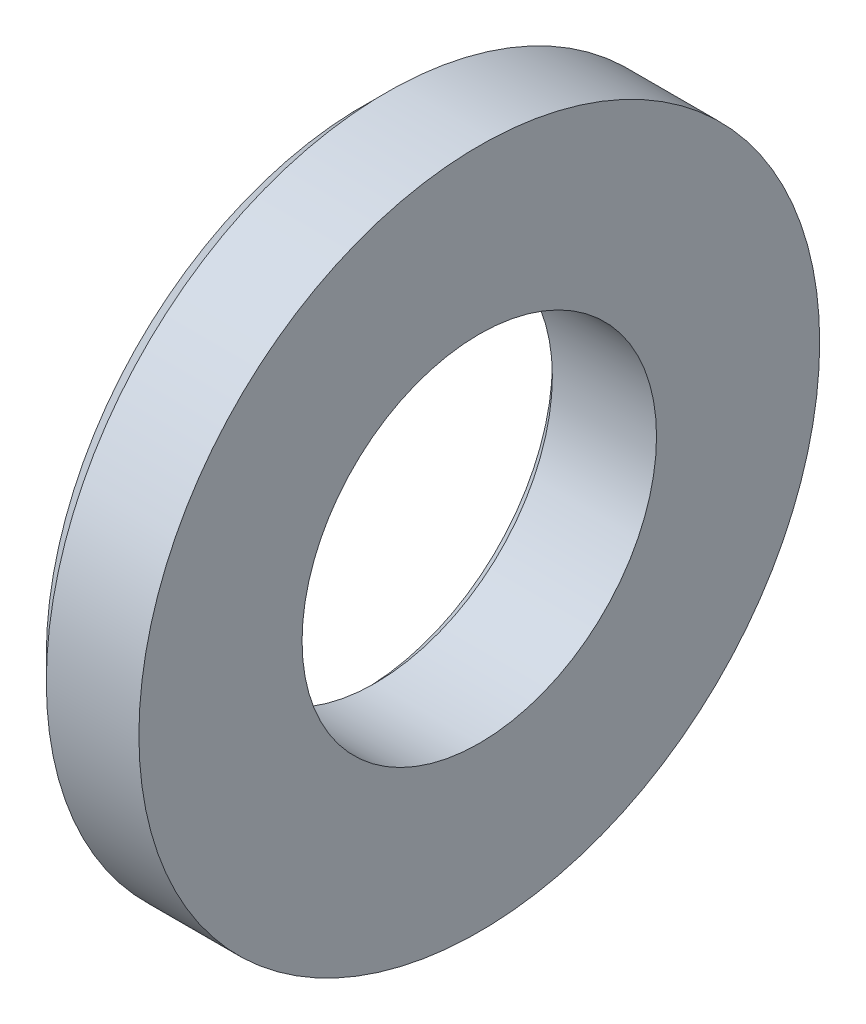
ISO-10303-21;
HEADER;
FILE_DESCRIPTION(('STEP AP214'),'2;1');
FILE_NAME('part.step','',(''),(''),'','','');
FILE_SCHEMA(('AUTOMOTIVE_DESIGN { 1 0 10303 214 1 1 1 1 }'));
ENDSEC;
DATA;
#1=APPLICATION_CONTEXT('core data for automotive mechanical design processes');
#2=APPLICATION_PROTOCOL_DEFINITION('international standard','automotive_design',2000,#1);
#3=PRODUCT_CONTEXT('',#1,'mechanical');
#4=PRODUCT('Part','Part','',(#3));
#5=PRODUCT_RELATED_PRODUCT_CATEGORY('part','',(#4));
#6=PRODUCT_DEFINITION_FORMATION('','',#4);
#7=PRODUCT_DEFINITION_CONTEXT('part definition',#1,'design');
#8=PRODUCT_DEFINITION('design','',#6,#7);
#9=PRODUCT_DEFINITION_SHAPE('','',#8);
#10=(LENGTH_UNIT() NAMED_UNIT(*) SI_UNIT(.MILLI.,.METRE.));
#11=(NAMED_UNIT(*) PLANE_ANGLE_UNIT() SI_UNIT($,.RADIAN.));
#12=(NAMED_UNIT(*) SI_UNIT($,.STERADIAN.) SOLID_ANGLE_UNIT());
#13=UNCERTAINTY_MEASURE_WITH_UNIT(LENGTH_MEASURE(1.E-05),#10,'distance_accuracy_value','');
#14=(GEOMETRIC_REPRESENTATION_CONTEXT(3) GLOBAL_UNCERTAINTY_ASSIGNED_CONTEXT((#13)) GLOBAL_UNIT_ASSIGNED_CONTEXT((#10,
#11,#12)) REPRESENTATION_CONTEXT('',''));
#15=CARTESIAN_POINT('',(0.,0.,0.));
#16=DIRECTION('',(0.,0.,1.));
#17=DIRECTION('',(1.,0.,0.));
#18=AXIS2_PLACEMENT_3D('',#15,#16,#17);
#19=CARTESIAN_POINT('',(3.2385,0.,0.));
#20=DIRECTION('',(1.,0.,0.));
#21=DIRECTION('',(0.,0.,-1.));
#22=AXIS2_PLACEMENT_3D('',#19,#20,#21);
#23=PLANE('',#22);
#24=CARTESIAN_POINT('',(3.2385,0.,0.));
#25=DIRECTION('',(1.,0.,0.));
#26=DIRECTION('',(0.,0.,-1.));
#27=AXIS2_PLACEMENT_3D('',#24,#25,#26);
#28=CIRCLE('',#27,19.05);
#29=CARTESIAN_POINT('',(3.2385,0.,-19.05));
#30=VERTEX_POINT('',#29);
#31=EDGE_CURVE('E50',#30,#30,#28,.T.);
#32=ORIENTED_EDGE('',*,*,#31,.T.);
#33=EDGE_LOOP('',(#32));
#34=FACE_BOUND('',#33,.T.);
#35=CARTESIAN_POINT('',(3.2385,0.,0.));
#36=DIRECTION('',(1.,0.,0.));
#37=DIRECTION('',(0.,0.,-1.));
#38=AXIS2_PLACEMENT_3D('',#35,#36,#37);
#39=CIRCLE('',#38,9.9187);
#40=CARTESIAN_POINT('',(3.2385,0.,-9.9187));
#41=VERTEX_POINT('',#40);
#42=EDGE_CURVE('E53',#41,#41,#39,.T.);
#43=ORIENTED_EDGE('',*,*,#42,.F.);
#44=EDGE_LOOP('',(#43));
#45=FACE_BOUND('',#44,.T.);
#46=ADVANCED_FACE('F30',(#34,#45),#23,.T.);
#47=CARTESIAN_POINT('',(-3.2385,0.,0.));
#48=DIRECTION('',(1.,0.,0.));
#49=DIRECTION('',(0.,0.,-1.));
#50=AXIS2_PLACEMENT_3D('',#47,#48,#49);
#51=PLANE('',#50);
#52=CARTESIAN_POINT('',(-3.2385,0.,0.));
#53=DIRECTION('',(1.,0.,0.));
#54=DIRECTION('',(0.,0.,-1.));
#55=AXIS2_PLACEMENT_3D('',#52,#53,#54);
#56=CIRCLE('',#55,10.5664);
#57=CARTESIAN_POINT('',(-3.2385,0.,-10.5664));
#58=VERTEX_POINT('',#57);
#59=EDGE_CURVE('E37',#58,#58,#56,.T.);
#60=ORIENTED_EDGE('',*,*,#59,.T.);
#61=EDGE_LOOP('',(#60));
#62=FACE_BOUND('',#61,.T.);
#63=CARTESIAN_POINT('',(-3.2385,0.,0.));
#64=DIRECTION('',(1.,0.,0.));
#65=DIRECTION('',(0.,0.,-1.));
#66=AXIS2_PLACEMENT_3D('',#63,#64,#65);
#67=CIRCLE('',#66,17.7546);
#68=CARTESIAN_POINT('',(-3.2385,0.,-17.7546));
#69=VERTEX_POINT('',#68);
#70=EDGE_CURVE('E41',#69,#69,#67,.F.);
#71=ORIENTED_EDGE('',*,*,#70,.T.);
#72=EDGE_LOOP('',(#71));
#73=FACE_BOUND('',#72,.T.);
#74=ADVANCED_FACE('F60',(#62,#73),#51,.F.);
#75=CARTESIAN_POINT('',(3.2385,0.,0.));
#76=DIRECTION('',(-1.,0.,0.));
#77=DIRECTION('',(0.,0.,1.));
#78=AXIS2_PLACEMENT_3D('',#75,#76,#77);
#79=CYLINDRICAL_SURFACE('',#78,19.05);
#80=CARTESIAN_POINT('',(-1.94310000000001,0.,0.));
#81=DIRECTION('',(1.,0.,0.));
#82=DIRECTION('',(0.,0.,-1.));
#83=AXIS2_PLACEMENT_3D('',#80,#81,#82);
#84=CIRCLE('',#83,19.05);
#85=CARTESIAN_POINT('',(-1.94310000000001,0.,-19.05));
#86=VERTEX_POINT('',#85);
#87=EDGE_CURVE('E45',#86,#86,#84,.T.);
#88=ORIENTED_EDGE('',*,*,#87,.T.);
#89=EDGE_LOOP('',(#88));
#90=FACE_BOUND('',#89,.T.);
#91=ORIENTED_EDGE('',*,*,#31,.F.);
#92=EDGE_LOOP('',(#91));
#93=FACE_BOUND('',#92,.T.);
#94=ADVANCED_FACE('F66',(#90,#93),#79,.T.);
#95=CARTESIAN_POINT('',(3.2385,0.,0.));
#96=DIRECTION('',(-1.,0.,0.));
#97=DIRECTION('',(0.,0.,1.));
#98=AXIS2_PLACEMENT_3D('',#95,#96,#97);
#99=CYLINDRICAL_SURFACE('',#98,9.9187);
#100=CARTESIAN_POINT('',(-2.59079999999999,0.,0.));
#101=DIRECTION('',(1.,0.,0.));
#102=DIRECTION('',(0.,0.,-1.));
#103=AXIS2_PLACEMENT_3D('',#100,#101,#102);
#104=CIRCLE('',#103,9.9187);
#105=CARTESIAN_POINT('',(-2.59079999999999,0.,-9.9187));
#106=VERTEX_POINT('',#105);
#107=EDGE_CURVE('E10',#106,#106,#104,.F.);
#108=ORIENTED_EDGE('',*,*,#107,.T.);
#109=EDGE_LOOP('',(#108));
#110=FACE_BOUND('',#109,.T.);
#111=ORIENTED_EDGE('',*,*,#42,.T.);
#112=EDGE_LOOP('',(#111));
#113=FACE_BOUND('',#112,.T.);
#114=ADVANCED_FACE('F57',(#110,#113),#99,.F.);
#115=CARTESIAN_POINT('',(-1.94310000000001,0.,0.));
#116=DIRECTION('',(1.,0.,0.));
#117=DIRECTION('',(0.,0.,-1.));
#118=AXIS2_PLACEMENT_3D('',#115,#116,#117);
#119=CONICAL_SURFACE('',#118,19.05,0.785398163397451);
#120=ORIENTED_EDGE('',*,*,#70,.F.);
#121=EDGE_LOOP('',(#120));
#122=FACE_BOUND('',#121,.T.);
#123=ORIENTED_EDGE('',*,*,#87,.F.);
#124=EDGE_LOOP('',(#123));
#125=FACE_BOUND('',#124,.T.);
#126=ADVANCED_FACE('F72',(#122,#125),#119,.T.);
#127=CARTESIAN_POINT('',(-3.2385,0.,0.));
#128=DIRECTION('',(-1.,0.,0.));
#129=DIRECTION('',(0.,0.,1.));
#130=AXIS2_PLACEMENT_3D('',#127,#128,#129);
#131=CONICAL_SURFACE('',#130,10.5664,0.785398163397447);
#132=ORIENTED_EDGE('',*,*,#107,.F.);
#133=EDGE_LOOP('',(#132));
#134=FACE_BOUND('',#133,.T.);
#135=ORIENTED_EDGE('',*,*,#59,.F.);
#136=EDGE_LOOP('',(#135));
#137=FACE_BOUND('',#136,.T.);
#138=ADVANCED_FACE('F32',(#134,#137),#131,.F.);
#139=CLOSED_SHELL('',(#46,#74,#94,#114,#126,#138));
#140=MANIFOLD_SOLID_BREP('B2',#139);
#141=ADVANCED_BREP_SHAPE_REPRESENTATION('',(#18,#140),#14);
#142=SHAPE_DEFINITION_REPRESENTATION(#9,#141);
ENDSEC;
END-ISO-10303-21;
